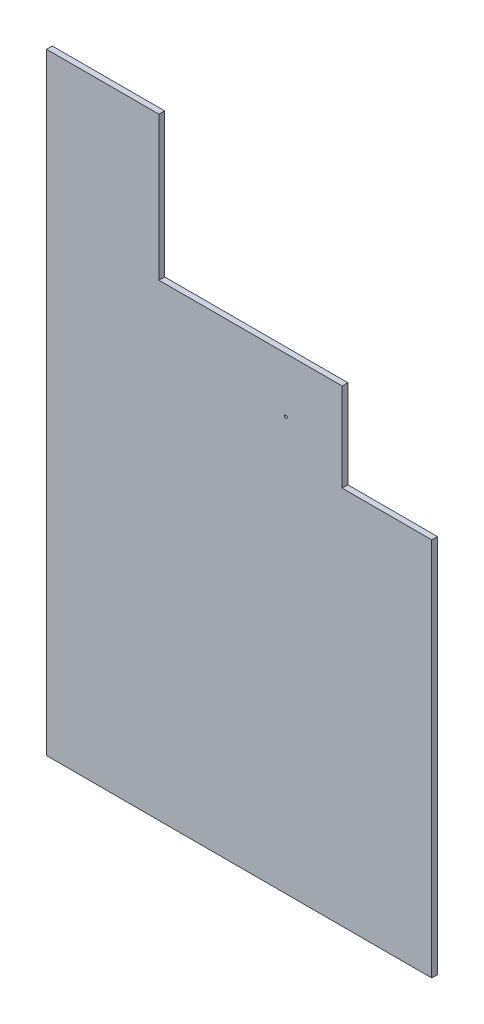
ISO-10303-21;
HEADER;
FILE_DESCRIPTION(('STEP AP214'),'2;1');
FILE_NAME('part.step','',(''),(''),'','','');
FILE_SCHEMA(('AUTOMOTIVE_DESIGN { 1 0 10303 214 1 1 1 1 }'));
ENDSEC;
DATA;
#1=APPLICATION_CONTEXT('core data for automotive mechanical design processes');
#2=APPLICATION_PROTOCOL_DEFINITION('international standard','automotive_design',2000,#1);
#3=PRODUCT_CONTEXT('',#1,'mechanical');
#4=PRODUCT('Part','Part','',(#3));
#5=PRODUCT_RELATED_PRODUCT_CATEGORY('part','',(#4));
#6=PRODUCT_DEFINITION_FORMATION('','',#4);
#7=PRODUCT_DEFINITION_CONTEXT('part definition',#1,'design');
#8=PRODUCT_DEFINITION('design','',#6,#7);
#9=PRODUCT_DEFINITION_SHAPE('','',#8);
#10=(LENGTH_UNIT() NAMED_UNIT(*) SI_UNIT(.MILLI.,.METRE.));
#11=(NAMED_UNIT(*) PLANE_ANGLE_UNIT() SI_UNIT($,.RADIAN.));
#12=(NAMED_UNIT(*) SI_UNIT($,.STERADIAN.) SOLID_ANGLE_UNIT());
#13=UNCERTAINTY_MEASURE_WITH_UNIT(LENGTH_MEASURE(1.E-05),#10,'distance_accuracy_value','');
#14=(GEOMETRIC_REPRESENTATION_CONTEXT(3) GLOBAL_UNCERTAINTY_ASSIGNED_CONTEXT((#13)) GLOBAL_UNIT_ASSIGNED_CONTEXT((#10,
#11,#12)) REPRESENTATION_CONTEXT('',''));
#15=CARTESIAN_POINT('',(0.,0.,0.));
#16=DIRECTION('',(0.,0.,1.));
#17=DIRECTION('',(1.,0.,0.));
#18=AXIS2_PLACEMENT_3D('',#15,#16,#17);
#19=CARTESIAN_POINT('',(0.,0.,10.));
#20=DIRECTION('',(0.,0.,-1.));
#21=DIRECTION('',(-1.,0.,0.));
#22=AXIS2_PLACEMENT_3D('',#19,#20,#21);
#23=PLANE('',#22);
#24=DIRECTION('',(0.,1.,0.));
#25=VECTOR('',#24,1.);
#26=CARTESIAN_POINT('',(0.,665.,10.));
#27=LINE('',#26,#25);
#28=CARTESIAN_POINT('',(0.,0.,10.));
#29=VERTEX_POINT('',#28);
#30=CARTESIAN_POINT('',(0.,665.,10.));
#31=VERTEX_POINT('',#30);
#32=EDGE_CURVE('E146',#29,#31,#27,.T.);
#33=ORIENTED_EDGE('',*,*,#32,.T.);
#34=DIRECTION('',(-1.,0.,0.));
#35=VECTOR('',#34,1.);
#36=CARTESIAN_POINT('',(-157.,665.,10.));
#37=LINE('',#36,#35);
#38=CARTESIAN_POINT('',(-157.,665.,10.));
#39=VERTEX_POINT('',#38);
#40=EDGE_CURVE('E94',#31,#39,#37,.T.);
#41=ORIENTED_EDGE('',*,*,#40,.T.);
#42=DIRECTION('',(0.,1.,0.));
#43=VECTOR('',#42,1.);
#44=CARTESIAN_POINT('',(-157.,820.,10.));
#45=LINE('',#44,#43);
#46=CARTESIAN_POINT('',(-157.,820.,10.));
#47=VERTEX_POINT('',#46);
#48=EDGE_CURVE('E161',#39,#47,#45,.T.);
#49=ORIENTED_EDGE('',*,*,#48,.T.);
#50=DIRECTION('',(-1.,0.,0.));
#51=VECTOR('',#50,1.);
#52=CARTESIAN_POINT('',(-478.,820.,10.));
#53=LINE('',#52,#51);
#54=CARTESIAN_POINT('',(-478.,820.,10.));
#55=VERTEX_POINT('',#54);
#56=EDGE_CURVE('E174',#47,#55,#53,.T.);
#57=ORIENTED_EDGE('',*,*,#56,.T.);
#58=DIRECTION('',(0.,1.,0.));
#59=VECTOR('',#58,1.);
#60=CARTESIAN_POINT('',(-478.,1072.,10.));
#61=LINE('',#60,#59);
#62=CARTESIAN_POINT('',(-478.,1072.,10.));
#63=VERTEX_POINT('',#62);
#64=EDGE_CURVE('E113',#55,#63,#61,.T.);
#65=ORIENTED_EDGE('',*,*,#64,.T.);
#66=DIRECTION('',(-1.,0.,0.));
#67=VECTOR('',#66,1.);
#68=CARTESIAN_POINT('',(-675.,1072.,10.));
#69=LINE('',#68,#67);
#70=CARTESIAN_POINT('',(-675.,1072.,10.));
#71=VERTEX_POINT('',#70);
#72=EDGE_CURVE('E107',#63,#71,#69,.T.);
#73=ORIENTED_EDGE('',*,*,#72,.T.);
#74=DIRECTION('',(0.,-1.,0.));
#75=VECTOR('',#74,1.);
#76=CARTESIAN_POINT('',(-675.,0.,10.));
#77=LINE('',#76,#75);
#78=CARTESIAN_POINT('',(-675.,0.,10.));
#79=VERTEX_POINT('',#78);
#80=EDGE_CURVE('E111',#71,#79,#77,.T.);
#81=ORIENTED_EDGE('',*,*,#80,.T.);
#82=DIRECTION('',(1.,0.,0.));
#83=VECTOR('',#82,1.);
#84=CARTESIAN_POINT('',(0.,0.,10.));
#85=LINE('',#84,#83);
#86=EDGE_CURVE('E51',#79,#29,#85,.T.);
#87=ORIENTED_EDGE('',*,*,#86,.T.);
#88=EDGE_LOOP('',(#33,#41,#49,#57,#65,#73,#81,#87));
#89=FACE_BOUND('',#88,.T.);
#90=CARTESIAN_POINT('',(-255.5,724.,10.));
#91=DIRECTION('',(0.,0.,1.));
#92=DIRECTION('',(1.,0.,0.));
#93=AXIS2_PLACEMENT_3D('',#90,#91,#92);
#94=CIRCLE('',#93,2.49999999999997);
#95=CARTESIAN_POINT('',(-253.,724.,10.));
#96=VERTEX_POINT('',#95);
#97=EDGE_CURVE('E135',#96,#96,#94,.T.);
#98=ORIENTED_EDGE('',*,*,#97,.F.);
#99=EDGE_LOOP('',(#98));
#100=FACE_BOUND('',#99,.T.);
#101=ADVANCED_FACE('F34',(#89,#100),#23,.F.);
#102=CARTESIAN_POINT('',(0.,0.,0.));
#103=DIRECTION('',(0.,0.,-1.));
#104=DIRECTION('',(-1.,0.,0.));
#105=AXIS2_PLACEMENT_3D('',#102,#103,#104);
#106=PLANE('',#105);
#107=DIRECTION('',(0.,1.,0.));
#108=VECTOR('',#107,1.);
#109=CARTESIAN_POINT('',(0.,665.,0.));
#110=LINE('',#109,#108);
#111=CARTESIAN_POINT('',(0.,0.,0.));
#112=VERTEX_POINT('',#111);
#113=CARTESIAN_POINT('',(0.,665.,0.));
#114=VERTEX_POINT('',#113);
#115=EDGE_CURVE('E131',#112,#114,#110,.T.);
#116=ORIENTED_EDGE('',*,*,#115,.F.);
#117=DIRECTION('',(1.,0.,0.));
#118=VECTOR('',#117,1.);
#119=CARTESIAN_POINT('',(0.,0.,0.));
#120=LINE('',#119,#118);
#121=CARTESIAN_POINT('',(-675.,0.,0.));
#122=VERTEX_POINT('',#121);
#123=EDGE_CURVE('E86',#122,#112,#120,.T.);
#124=ORIENTED_EDGE('',*,*,#123,.F.);
#125=DIRECTION('',(0.,-1.,0.));
#126=VECTOR('',#125,1.);
#127=CARTESIAN_POINT('',(-675.,0.,0.));
#128=LINE('',#127,#126);
#129=CARTESIAN_POINT('',(-675.,1072.,0.));
#130=VERTEX_POINT('',#129);
#131=EDGE_CURVE('E80',#130,#122,#128,.T.);
#132=ORIENTED_EDGE('',*,*,#131,.F.);
#133=DIRECTION('',(-1.,0.,0.));
#134=VECTOR('',#133,1.);
#135=CARTESIAN_POINT('',(-675.,1072.,0.));
#136=LINE('',#135,#134);
#137=CARTESIAN_POINT('',(-478.,1072.,0.));
#138=VERTEX_POINT('',#137);
#139=EDGE_CURVE('E121',#138,#130,#136,.T.);
#140=ORIENTED_EDGE('',*,*,#139,.F.);
#141=DIRECTION('',(0.,1.,0.));
#142=VECTOR('',#141,1.);
#143=CARTESIAN_POINT('',(-478.,1072.,0.));
#144=LINE('',#143,#142);
#145=CARTESIAN_POINT('',(-478.,820.,0.));
#146=VERTEX_POINT('',#145);
#147=EDGE_CURVE('E141',#146,#138,#144,.T.);
#148=ORIENTED_EDGE('',*,*,#147,.F.);
#149=DIRECTION('',(-1.,0.,0.));
#150=VECTOR('',#149,1.);
#151=CARTESIAN_POINT('',(-478.,820.,0.));
#152=LINE('',#151,#150);
#153=CARTESIAN_POINT('',(-157.,820.,0.));
#154=VERTEX_POINT('',#153);
#155=EDGE_CURVE('E139',#154,#146,#152,.T.);
#156=ORIENTED_EDGE('',*,*,#155,.F.);
#157=DIRECTION('',(0.,1.,0.));
#158=VECTOR('',#157,1.);
#159=CARTESIAN_POINT('',(-157.,820.,0.));
#160=LINE('',#159,#158);
#161=CARTESIAN_POINT('',(-157.,665.,0.));
#162=VERTEX_POINT('',#161);
#163=EDGE_CURVE('E137',#162,#154,#160,.T.);
#164=ORIENTED_EDGE('',*,*,#163,.F.);
#165=DIRECTION('',(-1.,0.,0.));
#166=VECTOR('',#165,1.);
#167=CARTESIAN_POINT('',(-157.,665.,0.));
#168=LINE('',#167,#166);
#169=EDGE_CURVE('E134',#114,#162,#168,.T.);
#170=ORIENTED_EDGE('',*,*,#169,.F.);
#171=EDGE_LOOP('',(#116,#124,#132,#140,#148,#156,#164,#170));
#172=FACE_BOUND('',#171,.T.);
#173=CARTESIAN_POINT('',(-255.5,724.,0.));
#174=DIRECTION('',(0.,0.,1.));
#175=DIRECTION('',(1.,0.,0.));
#176=AXIS2_PLACEMENT_3D('',#173,#174,#175);
#177=CIRCLE('',#176,2.49999999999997);
#178=CARTESIAN_POINT('',(-253.,724.,0.));
#179=VERTEX_POINT('',#178);
#180=EDGE_CURVE('E180',#179,#179,#177,.T.);
#181=ORIENTED_EDGE('',*,*,#180,.T.);
#182=EDGE_LOOP('',(#181));
#183=FACE_BOUND('',#182,.T.);
#184=ADVANCED_FACE('F165',(#172,#183),#106,.T.);
#185=CARTESIAN_POINT('',(0.,665.,10.));
#186=DIRECTION('',(-1.,0.,0.));
#187=DIRECTION('',(0.,-1.,0.));
#188=AXIS2_PLACEMENT_3D('',#185,#186,#187);
#189=PLANE('',#188);
#190=ORIENTED_EDGE('',*,*,#115,.T.);
#191=DIRECTION('',(0.,0.,-1.));
#192=VECTOR('',#191,1.);
#193=CARTESIAN_POINT('',(0.,665.,10.));
#194=LINE('',#193,#192);
#195=EDGE_CURVE('E11',#31,#114,#194,.T.);
#196=ORIENTED_EDGE('',*,*,#195,.F.);
#197=ORIENTED_EDGE('',*,*,#32,.F.);
#198=DIRECTION('',(0.,0.,-1.));
#199=VECTOR('',#198,1.);
#200=CARTESIAN_POINT('',(0.,0.,10.));
#201=LINE('',#200,#199);
#202=EDGE_CURVE('E127',#29,#112,#201,.T.);
#203=ORIENTED_EDGE('',*,*,#202,.T.);
#204=EDGE_LOOP('',(#190,#196,#197,#203));
#205=FACE_BOUND('',#204,.T.);
#206=ADVANCED_FACE('F36',(#205),#189,.F.);
#207=CARTESIAN_POINT('',(-157.,665.,10.));
#208=DIRECTION('',(0.,-1.,0.));
#209=DIRECTION('',(0.,0.,-1.));
#210=AXIS2_PLACEMENT_3D('',#207,#208,#209);
#211=PLANE('',#210);
#212=ORIENTED_EDGE('',*,*,#169,.T.);
#213=DIRECTION('',(0.,0.,-1.));
#214=VECTOR('',#213,1.);
#215=CARTESIAN_POINT('',(-157.,665.,10.));
#216=LINE('',#215,#214);
#217=EDGE_CURVE('E43',#39,#162,#216,.T.);
#218=ORIENTED_EDGE('',*,*,#217,.F.);
#219=ORIENTED_EDGE('',*,*,#40,.F.);
#220=ORIENTED_EDGE('',*,*,#195,.T.);
#221=EDGE_LOOP('',(#212,#218,#219,#220));
#222=FACE_BOUND('',#221,.T.);
#223=ADVANCED_FACE('F208',(#222),#211,.F.);
#224=CARTESIAN_POINT('',(-157.,820.,10.));
#225=DIRECTION('',(-1.,0.,0.));
#226=DIRECTION('',(0.,0.,1.));
#227=AXIS2_PLACEMENT_3D('',#224,#225,#226);
#228=PLANE('',#227);
#229=ORIENTED_EDGE('',*,*,#163,.T.);
#230=DIRECTION('',(0.,0.,-1.));
#231=VECTOR('',#230,1.);
#232=CARTESIAN_POINT('',(-157.,820.,10.));
#233=LINE('',#232,#231);
#234=EDGE_CURVE('E153',#47,#154,#233,.T.);
#235=ORIENTED_EDGE('',*,*,#234,.F.);
#236=ORIENTED_EDGE('',*,*,#48,.F.);
#237=ORIENTED_EDGE('',*,*,#217,.T.);
#238=EDGE_LOOP('',(#229,#235,#236,#237));
#239=FACE_BOUND('',#238,.T.);
#240=ADVANCED_FACE('F159',(#239),#228,.F.);
#241=CARTESIAN_POINT('',(-478.,820.,10.));
#242=DIRECTION('',(0.,-1.,0.));
#243=DIRECTION('',(0.,0.,-1.));
#244=AXIS2_PLACEMENT_3D('',#241,#242,#243);
#245=PLANE('',#244);
#246=ORIENTED_EDGE('',*,*,#155,.T.);
#247=DIRECTION('',(0.,0.,-1.));
#248=VECTOR('',#247,1.);
#249=CARTESIAN_POINT('',(-478.,820.,10.));
#250=LINE('',#249,#248);
#251=EDGE_CURVE('E150',#55,#146,#250,.T.);
#252=ORIENTED_EDGE('',*,*,#251,.F.);
#253=ORIENTED_EDGE('',*,*,#56,.F.);
#254=ORIENTED_EDGE('',*,*,#234,.T.);
#255=EDGE_LOOP('',(#246,#252,#253,#254));
#256=FACE_BOUND('',#255,.T.);
#257=ADVANCED_FACE('F170',(#256),#245,.F.);
#258=CARTESIAN_POINT('',(-478.,1072.,10.));
#259=DIRECTION('',(-1.,0.,0.));
#260=DIRECTION('',(0.,0.,1.));
#261=AXIS2_PLACEMENT_3D('',#258,#259,#260);
#262=PLANE('',#261);
#263=ORIENTED_EDGE('',*,*,#147,.T.);
#264=DIRECTION('',(0.,0.,-1.));
#265=VECTOR('',#264,1.);
#266=CARTESIAN_POINT('',(-478.,1072.,10.));
#267=LINE('',#266,#265);
#268=EDGE_CURVE('E122',#63,#138,#267,.T.);
#269=ORIENTED_EDGE('',*,*,#268,.F.);
#270=ORIENTED_EDGE('',*,*,#64,.F.);
#271=ORIENTED_EDGE('',*,*,#251,.T.);
#272=EDGE_LOOP('',(#263,#269,#270,#271));
#273=FACE_BOUND('',#272,.T.);
#274=ADVANCED_FACE('F173',(#273),#262,.F.);
#275=CARTESIAN_POINT('',(-675.,1072.,10.));
#276=DIRECTION('',(0.,-1.,0.));
#277=DIRECTION('',(0.,0.,-1.));
#278=AXIS2_PLACEMENT_3D('',#275,#276,#277);
#279=PLANE('',#278);
#280=ORIENTED_EDGE('',*,*,#139,.T.);
#281=DIRECTION('',(0.,0.,-1.));
#282=VECTOR('',#281,1.);
#283=CARTESIAN_POINT('',(-675.,1072.,10.));
#284=LINE('',#283,#282);
#285=EDGE_CURVE('E118',#71,#130,#284,.T.);
#286=ORIENTED_EDGE('',*,*,#285,.F.);
#287=ORIENTED_EDGE('',*,*,#72,.F.);
#288=ORIENTED_EDGE('',*,*,#268,.T.);
#289=EDGE_LOOP('',(#280,#286,#287,#288));
#290=FACE_BOUND('',#289,.T.);
#291=ADVANCED_FACE('F119',(#290),#279,.F.);
#292=CARTESIAN_POINT('',(-675.,0.,10.));
#293=DIRECTION('',(1.,0.,0.));
#294=DIRECTION('',(0.,0.,-1.));
#295=AXIS2_PLACEMENT_3D('',#292,#293,#294);
#296=PLANE('',#295);
#297=ORIENTED_EDGE('',*,*,#131,.T.);
#298=DIRECTION('',(0.,0.,-1.));
#299=VECTOR('',#298,1.);
#300=CARTESIAN_POINT('',(-675.,0.,10.));
#301=LINE('',#300,#299);
#302=EDGE_CURVE('E123',#79,#122,#301,.T.);
#303=ORIENTED_EDGE('',*,*,#302,.F.);
#304=ORIENTED_EDGE('',*,*,#80,.F.);
#305=ORIENTED_EDGE('',*,*,#285,.T.);
#306=EDGE_LOOP('',(#297,#303,#304,#305));
#307=FACE_BOUND('',#306,.T.);
#308=ADVANCED_FACE('F125',(#307),#296,.F.);
#309=CARTESIAN_POINT('',(0.,0.,10.));
#310=DIRECTION('',(0.,1.,0.));
#311=DIRECTION('',(-1.,0.,0.));
#312=AXIS2_PLACEMENT_3D('',#309,#310,#311);
#313=PLANE('',#312);
#314=ORIENTED_EDGE('',*,*,#123,.T.);
#315=ORIENTED_EDGE('',*,*,#202,.F.);
#316=ORIENTED_EDGE('',*,*,#86,.F.);
#317=ORIENTED_EDGE('',*,*,#302,.T.);
#318=EDGE_LOOP('',(#314,#315,#316,#317));
#319=FACE_BOUND('',#318,.T.);
#320=ADVANCED_FACE('F196',(#319),#313,.F.);
#321=CARTESIAN_POINT('',(-255.5,724.,10.));
#322=DIRECTION('',(0.,0.,-1.));
#323=DIRECTION('',(-1.,0.,0.));
#324=AXIS2_PLACEMENT_3D('',#321,#322,#323);
#325=CYLINDRICAL_SURFACE('',#324,2.49999999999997);
#326=ORIENTED_EDGE('',*,*,#97,.T.);
#327=EDGE_LOOP('',(#326));
#328=FACE_BOUND('',#327,.T.);
#329=ORIENTED_EDGE('',*,*,#180,.F.);
#330=EDGE_LOOP('',(#329));
#331=FACE_BOUND('',#330,.T.);
#332=ADVANCED_FACE('F186',(#328,#331),#325,.F.);
#333=CLOSED_SHELL('',(#101,#184,#206,#223,#240,#257,#274,#291,#308,#320,#332));
#334=MANIFOLD_SOLID_BREP('B2',#333);
#335=ADVANCED_BREP_SHAPE_REPRESENTATION('',(#18,#334),#14);
#336=SHAPE_DEFINITION_REPRESENTATION(#9,#335);
ENDSEC;
END-ISO-10303-21;
